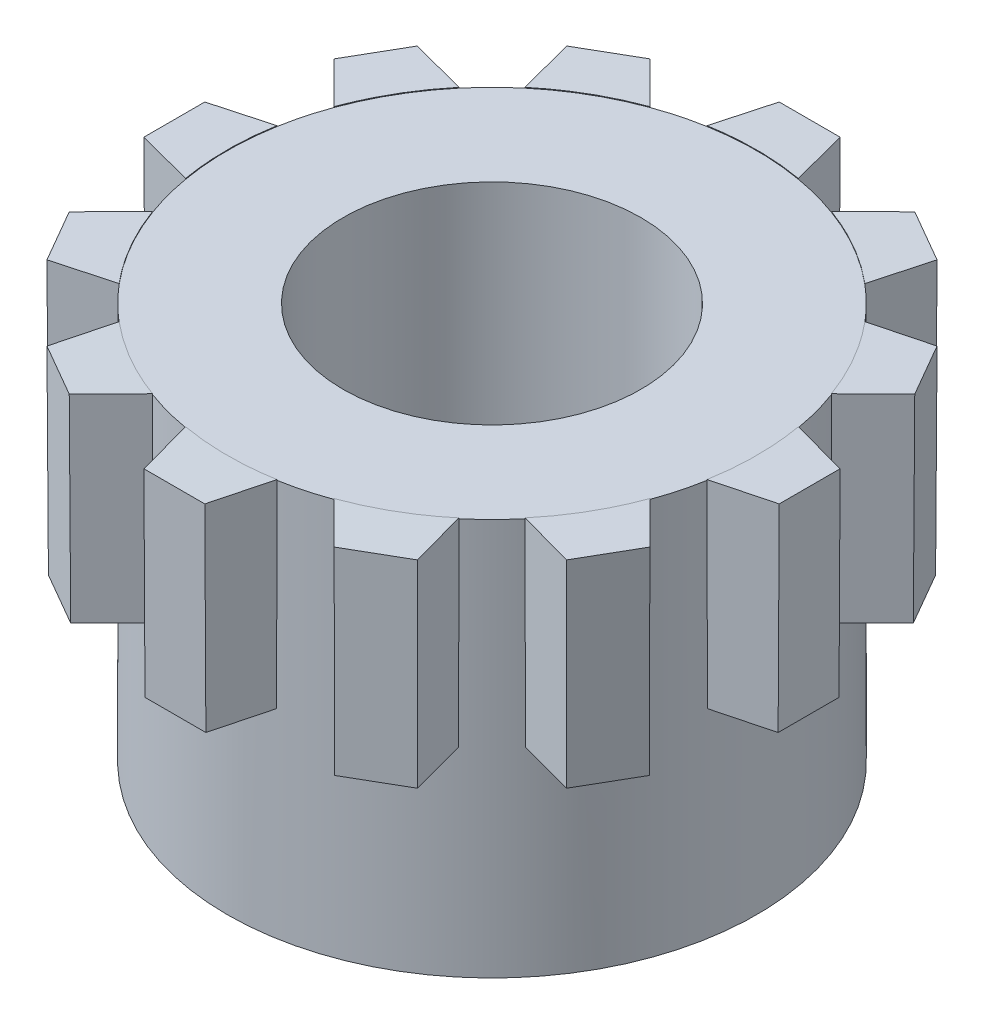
from build123d import *

# Parameters (mm, degrees)
SKETCH1_W         = 2.2225
SKETCH1_H         = 7.62
EXTRUDE1_DEPTH    = 3.81
CIRPATTERN1_COUNT = 12


with BuildPart() as part:
    # Sketch1 → Revolve1 (revolve)
    with BuildSketch(Plane.XY, mode=Mode.PRIVATE) as revolve1_sk:
        with Locations((3.96875, 3.81)):
            Rectangle(SKETCH1_W, SKETCH1_H)
    revolve(revolve1_sk.sketch.rotate(Axis((0, 0, 0), (0, 1, 0)), 90), axis=Axis((0, 0, 0), (0, 1, 0)))

    # Sketch3 → Extrude1 (add)
    with BuildSketch(Plane(origin=(7.62, 7.62, 0), x_dir=(-0.999985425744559, 0.005398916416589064, 0), z_dir=(0.005398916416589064, 0.999985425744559, 0))):
        with BuildLine():
            add(Edge.make_bspline(
                [(2.539962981, 0), (2.539962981, -0.441749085), (2.616212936, -0.876867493)],
                knots=[1.570796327, 1.570796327, 1.570796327, 1.744276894, 1.744276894, 1.744276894], degree=2, weights=[0.992494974, 0.992494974, 1]))
            Line((2.539962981, 0), (1.523962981, 0))
            Line((1.523962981, 0), (1.523962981, -0.5842))
            Line((1.523962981, -0.5842), (2.616212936, -0.876867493))
        make_face()
        with BuildLine():
            Line((1.523962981, 0), (2.539962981, 0))
            add(Edge.make_bspline(
                [(2.616212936, 0.876867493), (2.539962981, 0.441749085), (2.539962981, 0)],
                knots=[1.39731576, 1.39731576, 1.39731576, 1.570796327, 1.570796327, 1.570796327], degree=2, weights=[1, 0.992494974, 0.992494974]))
            Line((2.616212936, 0.876867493), (1.523962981, 0.5842))
            Line((1.523962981, 0.5842), (1.523962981, 0))
        make_face()
    extrude1 = extrude(amount=-EXTRUDE1_DEPTH)

    # CirPattern1: Extrude1 ×12 about axis
    cirpattern1_axis = Axis((0, 0, 0), (0, 1, 0))
    for i in range(1, CIRPATTERN1_COUNT):
        add(extrude1.rotate(cirpattern1_axis, i * 360 / CIRPATTERN1_COUNT))


solid = part.part
